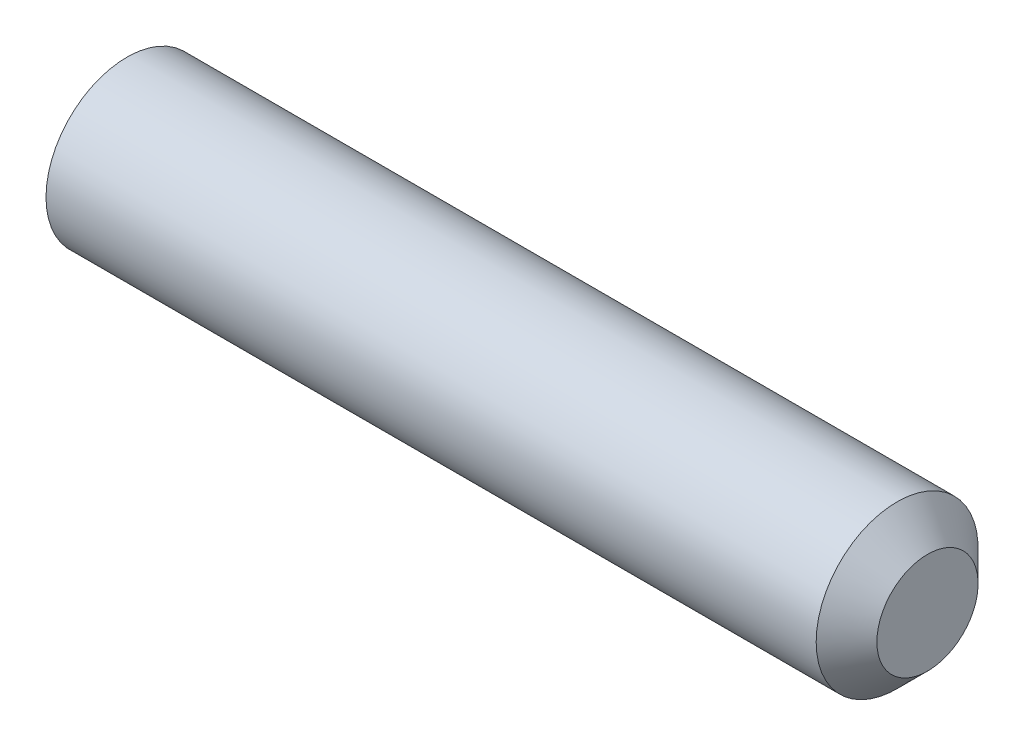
from build123d import *

# Parameters (mm, degrees)
HEX_2_DEPTH = 2.5


with BuildPart() as part:
    # BodySke → BaseBody (revolve)
    with BuildSketch(Plane.XY, mode=Mode.PRIVATE) as basebody_sk:
        Polygon((0, 0), (0, 1.61), (0.225166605, 2), (19.25, 2), (20, 1.25), (20, 0), align=None)
    revolve(basebody_sk.sketch.rotate(Axis((-12.7, 0, 0), (1, 0, 0)), 90), axis=Axis((-12.7, 0, 0), (1, 0, 0)))

    # Sketch2 → Hex 2 (cut)
    with BuildSketch(Plane.ZY):
        Polygon((0.577350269, 1), (-0.577350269, 1), (-1.154700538, 0), (-0.577350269, -1), (0.577350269, -1), (1.154700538, 0), align=None)
    extrude(amount=-HEX_2_DEPTH, mode=Mode.SUBTRACT)


solid = part.part
